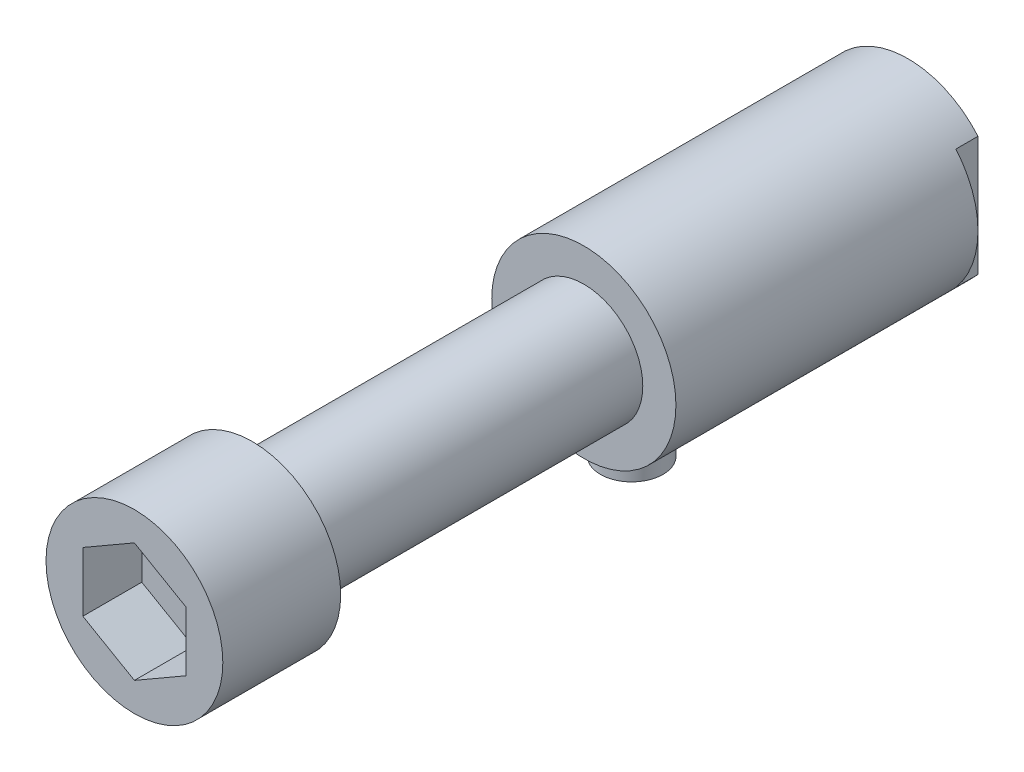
ISO-10303-21;
HEADER;
FILE_DESCRIPTION(('STEP AP214'),'2;1');
FILE_NAME('part.step','',(''),(''),'','','');
FILE_SCHEMA(('AUTOMOTIVE_DESIGN { 1 0 10303 214 1 1 1 1 }'));
ENDSEC;
DATA;
#1=APPLICATION_CONTEXT('core data for automotive mechanical design processes');
#2=APPLICATION_PROTOCOL_DEFINITION('international standard','automotive_design',2000,#1);
#3=PRODUCT_CONTEXT('',#1,'mechanical');
#4=PRODUCT('Part','Part','',(#3));
#5=PRODUCT_RELATED_PRODUCT_CATEGORY('part','',(#4));
#6=PRODUCT_DEFINITION_FORMATION('','',#4);
#7=PRODUCT_DEFINITION_CONTEXT('part definition',#1,'design');
#8=PRODUCT_DEFINITION('design','',#6,#7);
#9=PRODUCT_DEFINITION_SHAPE('','',#8);
#10=(LENGTH_UNIT() NAMED_UNIT(*) SI_UNIT(.MILLI.,.METRE.));
#11=(NAMED_UNIT(*) PLANE_ANGLE_UNIT() SI_UNIT($,.RADIAN.));
#12=(NAMED_UNIT(*) SI_UNIT($,.STERADIAN.) SOLID_ANGLE_UNIT());
#13=UNCERTAINTY_MEASURE_WITH_UNIT(LENGTH_MEASURE(1.E-05),#10,'distance_accuracy_value','');
#14=(GEOMETRIC_REPRESENTATION_CONTEXT(3) GLOBAL_UNCERTAINTY_ASSIGNED_CONTEXT((#13)) GLOBAL_UNIT_ASSIGNED_CONTEXT((#10,
#11,#12)) REPRESENTATION_CONTEXT('',''));
#15=CARTESIAN_POINT('',(0.,0.,0.));
#16=DIRECTION('',(0.,0.,1.));
#17=DIRECTION('',(1.,0.,0.));
#18=AXIS2_PLACEMENT_3D('',#15,#16,#17);
#19=CARTESIAN_POINT('',(0.,0.,0.));
#20=DIRECTION('',(0.,0.,1.));
#21=DIRECTION('',(1.,0.,0.));
#22=AXIS2_PLACEMENT_3D('',#19,#20,#21);
#23=CYLINDRICAL_SURFACE('',#22,12.5);
#24=CARTESIAN_POINT('',(0.,-12.5,33.25));
#25=CARTESIAN_POINT('',(0.231629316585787,-12.5000013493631,33.2499979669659));
#26=CARTESIAN_POINT('',(0.463244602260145,-12.493502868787,33.2689973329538));
#27=CARTESIAN_POINT('',(0.919637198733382,-12.4682205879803,33.3442489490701));
#28=CARTESIAN_POINT('',(1.14441406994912,-12.4494359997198,33.4005035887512));
#29=CARTESIAN_POINT('',(1.58048439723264,-12.4016188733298,33.5481034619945));
#30=CARTESIAN_POINT('',(1.79180021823,-12.3726038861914,33.639388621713));
#31=CARTESIAN_POINT('',(2.19612038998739,-12.3072763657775,33.8541815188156));
#32=CARTESIAN_POINT('',(2.38912089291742,-12.270962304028,33.9776960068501));
#33=CARTESIAN_POINT('',(2.75825261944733,-12.1933910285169,34.2580893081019));
#34=CARTESIAN_POINT('',(2.93363688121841,-12.1520119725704,34.4159175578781));
#35=CARTESIAN_POINT('',(3.25602333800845,-12.069633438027,34.7584402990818));
#36=CARTESIAN_POINT('',(3.40301894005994,-12.0286340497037,34.9431410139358));
#37=CARTESIAN_POINT('',(3.66879190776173,-11.9503048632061,35.3409772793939));
#38=CARTESIAN_POINT('',(3.78658554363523,-11.9131228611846,35.5548019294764));
#39=CARTESIAN_POINT('',(3.98421855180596,-11.8484975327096,36.000694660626));
#40=CARTESIAN_POINT('',(4.0640700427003,-11.8210510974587,36.2327568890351));
#41=CARTESIAN_POINT('',(4.18072715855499,-11.7802904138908,36.7000245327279));
#42=CARTESIAN_POINT('',(4.21893677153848,-11.7665167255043,36.9348381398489));
#43=CARTESIAN_POINT('',(4.25561504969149,-11.7533040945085,37.4079165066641));
#44=CARTESIAN_POINT('',(4.25409658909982,-11.7538605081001,37.6461801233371));
#45=CARTESIAN_POINT('',(4.21244934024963,-11.7688435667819,38.1072949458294));
#46=CARTESIAN_POINT('',(4.1741694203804,-11.7826060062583,38.3303385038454));
#47=CARTESIAN_POINT('',(4.06310816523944,-11.8213609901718,38.766625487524));
#48=CARTESIAN_POINT('',(3.99032254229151,-11.8463549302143,38.9798676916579));
#49=CARTESIAN_POINT('',(3.81113653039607,-11.9052184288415,39.3946323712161));
#50=CARTESIAN_POINT('',(3.70419900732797,-11.9392282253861,39.5959020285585));
#51=CARTESIAN_POINT('',(3.46011773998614,-12.0122344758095,39.9782170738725));
#52=CARTESIAN_POINT('',(3.3229649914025,-12.0512324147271,40.1592564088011));
#53=CARTESIAN_POINT('',(3.01353124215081,-12.1324166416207,40.506338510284));
#54=CARTESIAN_POINT('',(2.8397439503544,-12.1746609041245,40.6710276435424));
#55=CARTESIAN_POINT('',(2.46650176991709,-12.2557250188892,40.969285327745));
#56=CARTESIAN_POINT('',(2.26704421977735,-12.294544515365,41.102850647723));
#57=CARTESIAN_POINT('',(1.84516436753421,-12.3649312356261,41.3362182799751));
#58=CARTESIAN_POINT('',(1.62251944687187,-12.3964165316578,41.4356445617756));
#59=CARTESIAN_POINT('',(1.16233553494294,-12.4479909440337,41.5952073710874));
#60=CARTESIAN_POINT('',(0.924801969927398,-12.4680841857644,41.6553581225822));
#61=CARTESIAN_POINT('',(0.453032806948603,-12.4939206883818,41.7322333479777));
#62=CARTESIAN_POINT('',(0.219127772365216,-12.5002675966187,41.7507859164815));
#63=CARTESIAN_POINT('',(-0.248508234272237,-12.499715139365,41.7491633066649));
#64=CARTESIAN_POINT('',(-0.482239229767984,-12.4928181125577,41.7289949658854));
#65=CARTESIAN_POINT('',(-0.935487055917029,-12.4669514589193,41.6519417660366));
#66=CARTESIAN_POINT('',(-1.1552199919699,-12.4483547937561,41.5961904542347));
#67=CARTESIAN_POINT('',(-1.58211571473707,-12.4013331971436,41.450982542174));
#68=CARTESIAN_POINT('',(-1.78927688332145,-12.3729070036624,41.361521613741));
#69=CARTESIAN_POINT('',(-2.19135854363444,-12.3081499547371,41.1487765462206));
#70=CARTESIAN_POINT('',(-2.38580051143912,-12.2716272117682,41.024648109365));
#71=CARTESIAN_POINT('',(-2.75168306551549,-12.1948041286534,40.7470771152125));
#72=CARTESIAN_POINT('',(-2.92311635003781,-12.1545025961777,40.5936252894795));
#73=CARTESIAN_POINT('',(-3.24657351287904,-12.0722386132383,40.2531724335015));
#74=CARTESIAN_POINT('',(-3.39729328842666,-12.0302879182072,40.064926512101));
#75=CARTESIAN_POINT('',(-3.66518020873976,-11.9514023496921,39.6649221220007));
#76=CARTESIAN_POINT('',(-3.78234674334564,-11.914467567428,39.4531632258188));
#77=CARTESIAN_POINT('',(-3.97933669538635,-11.8501336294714,39.0118433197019));
#78=CARTESIAN_POINT('',(-4.05920753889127,-11.8227223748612,38.782305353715));
#79=CARTESIAN_POINT('',(-4.1787762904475,-11.7809981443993,38.3118824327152));
#80=CARTESIAN_POINT('',(-4.21849327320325,-11.7666789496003,38.0710029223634));
#81=CARTESIAN_POINT('',(-4.25510290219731,-11.7534862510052,37.5985747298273));
#82=CARTESIAN_POINT('',(-4.25416884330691,-11.7538288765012,37.367214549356));
#83=CARTESIAN_POINT('',(-4.21488538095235,-11.7679720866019,36.9081334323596));
#84=CARTESIAN_POINT('',(-4.17653837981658,-11.781771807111,36.6804122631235));
#85=CARTESIAN_POINT('',(-4.06508169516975,-11.8206793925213,36.2397513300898));
#86=CARTESIAN_POINT('',(-3.99270334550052,-11.8455487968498,36.0266038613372));
#87=CARTESIAN_POINT('',(-3.81583792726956,-11.9036971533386,35.6153188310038));
#88=CARTESIAN_POINT('',(-3.71134355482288,-11.9369780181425,35.4171846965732));
#89=CARTESIAN_POINT('',(-3.46772073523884,-12.0100690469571,35.0318662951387));
#90=CARTESIAN_POINT('',(-3.32724348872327,-12.0501058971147,34.8455781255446));
#91=CARTESIAN_POINT('',(-3.01789256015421,-12.1312763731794,34.4985180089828));
#92=CARTESIAN_POINT('',(-2.84901069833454,-12.1724103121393,34.337753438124));
#93=CARTESIAN_POINT('',(-2.47930158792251,-12.2531734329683,34.0396203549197));
#94=CARTESIAN_POINT('',(-2.27744544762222,-12.2926709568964,33.9034874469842));
#95=CARTESIAN_POINT('',(-1.85239769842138,-12.3638575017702,33.6672194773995));
#96=CARTESIAN_POINT('',(-1.62921053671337,-12.3955481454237,33.5670769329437));
#97=CARTESIAN_POINT('',(-1.17498554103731,-12.4466848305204,33.4088004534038));
#98=CARTESIAN_POINT('',(-0.944413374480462,-12.4664836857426,33.3494476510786));
#99=CARTESIAN_POINT('',(-0.475887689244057,-12.4931386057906,33.2700544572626));
#100=CARTESIAN_POINT('',(-0.237936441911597,-12.4999986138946,33.2500020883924));
#101=CARTESIAN_POINT('',(0.,-12.5,33.25));
#102=B_SPLINE_CURVE_WITH_KNOTS('',3,(#24,#25,#26,#27,#28,#29,#30,#31,#32,#33,#34,#35,#36,#37,
#38,#39,#40,#41,#42,#43,#44,#45,#46,#47,#48,#49,#50,#51,#52,#53,#54,#55,#56,#57,#58,#59,#60,#61,
#62,#63,#64,#65,#66,#67,#68,#69,#70,#71,#72,#73,#74,#75,#76,#77,#78,#79,#80,#81,#82,#83,#84,#85,
#86,#87,#88,#89,#90,#91,#92,#93,#94,#95,#96,#97,#98,#99,#100,#101),.UNSPECIFIED.,.T.,.F.,(4,2,2,
2,2,2,2,2,2,2,2,2,2,2,2,2,2,2,2,2,2,2,2,2,2,2,2,2,2,2,2,2,2,2,2,2,2,2,4),(0.,0.694012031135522,
1.38806858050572,2.08094017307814,2.77395700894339,3.48937549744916,4.20495993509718,
4.94210626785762,5.67901699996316,6.39023024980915,7.10121302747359,7.7782140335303,
8.45529918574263,9.14360628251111,9.83211877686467,10.5581272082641,11.2842109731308,
12.0180534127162,12.7516299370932,13.4522781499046,14.1528026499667,14.8320547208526,
15.5113940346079,16.2089885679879,16.9068039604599,17.6376748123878,18.3685589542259,
19.0985111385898,19.8281164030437,20.5187658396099,21.2093709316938,21.8857695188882,
22.5623220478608,23.2693695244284,23.976620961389,24.7129879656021,25.4492017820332,
26.1623287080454,26.8752382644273),.UNSPECIFIED.);
#103=CARTESIAN_POINT('',(0.,-12.5,33.25));
#104=VERTEX_POINT('',#103);
#105=EDGE_CURVE('E9',#104,#104,#102,.T.);
#106=ORIENTED_EDGE('',*,*,#105,.F.);
#107=EDGE_LOOP('',(#106));
#108=FACE_BOUND('',#107,.T.);
#109=CARTESIAN_POINT('',(0.,0.,0.));
#110=DIRECTION('',(0.,0.,-1.));
#111=DIRECTION('',(-1.,0.,0.));
#112=AXIS2_PLACEMENT_3D('',#109,#110,#111);
#113=CIRCLE('',#112,12.5);
#114=CARTESIAN_POINT('',(9.5,-8.12403840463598,0.));
#115=VERTEX_POINT('',#114);
#116=CARTESIAN_POINT('',(-9.5,-8.12403840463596,0.));
#117=VERTEX_POINT('',#116);
#118=EDGE_CURVE('E155',#115,#117,#113,.T.);
#119=ORIENTED_EDGE('',*,*,#118,.F.);
#120=DIRECTION('',(0.,0.,-1.));
#121=VECTOR('',#120,1.);
#122=CARTESIAN_POINT('',(9.5,-8.12403840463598,3.));
#123=LINE('',#122,#121);
#124=CARTESIAN_POINT('',(9.5,-8.12403840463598,3.));
#125=VERTEX_POINT('',#124);
#126=EDGE_CURVE('E136',#125,#115,#123,.T.);
#127=ORIENTED_EDGE('',*,*,#126,.F.);
#128=CARTESIAN_POINT('',(0.,0.,3.));
#129=DIRECTION('',(0.,0.,-1.));
#130=DIRECTION('',(-1.,0.,0.));
#131=AXIS2_PLACEMENT_3D('',#128,#129,#130);
#132=CIRCLE('',#131,12.5);
#133=CARTESIAN_POINT('',(9.5,8.12403840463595,3.));
#134=VERTEX_POINT('',#133);
#135=EDGE_CURVE('E140',#134,#125,#132,.T.);
#136=ORIENTED_EDGE('',*,*,#135,.F.);
#137=DIRECTION('',(0.,0.,-1.));
#138=VECTOR('',#137,1.);
#139=CARTESIAN_POINT('',(9.5,8.12403840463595,3.));
#140=LINE('',#139,#138);
#141=CARTESIAN_POINT('',(9.5,8.12403840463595,0.));
#142=VERTEX_POINT('',#141);
#143=EDGE_CURVE('E133',#134,#142,#140,.T.);
#144=ORIENTED_EDGE('',*,*,#143,.T.);
#145=CARTESIAN_POINT('',(-9.5,8.12403840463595,0.));
#146=VERTEX_POINT('',#145);
#147=EDGE_CURVE('E148',#146,#142,#113,.T.);
#148=ORIENTED_EDGE('',*,*,#147,.F.);
#149=DIRECTION('',(0.,0.,-1.));
#150=VECTOR('',#149,1.);
#151=CARTESIAN_POINT('',(-9.5,8.12403840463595,3.));
#152=LINE('',#151,#150);
#153=CARTESIAN_POINT('',(-9.5,8.12403840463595,3.));
#154=VERTEX_POINT('',#153);
#155=EDGE_CURVE('E604',#154,#146,#152,.T.);
#156=ORIENTED_EDGE('',*,*,#155,.F.);
#157=CARTESIAN_POINT('',(0.,0.,3.));
#158=DIRECTION('',(0.,0.,-1.));
#159=DIRECTION('',(-1.,0.,0.));
#160=AXIS2_PLACEMENT_3D('',#157,#158,#159);
#161=CIRCLE('',#160,12.5);
#162=CARTESIAN_POINT('',(-9.5,-8.12403840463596,3.));
#163=VERTEX_POINT('',#162);
#164=EDGE_CURVE('E611',#163,#154,#161,.T.);
#165=ORIENTED_EDGE('',*,*,#164,.F.);
#166=DIRECTION('',(0.,0.,-1.));
#167=VECTOR('',#166,1.);
#168=CARTESIAN_POINT('',(-9.5,-8.12403840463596,3.));
#169=LINE('',#168,#167);
#170=EDGE_CURVE('E602',#163,#117,#169,.T.);
#171=ORIENTED_EDGE('',*,*,#170,.T.);
#172=EDGE_LOOP('',(#119,#127,#136,#144,#148,#156,#165,#171));
#173=FACE_BOUND('',#172,.T.);
#174=CARTESIAN_POINT('',(0.,0.,44.));
#175=DIRECTION('',(0.,0.,-1.));
#176=DIRECTION('',(-1.,0.,0.));
#177=AXIS2_PLACEMENT_3D('',#174,#175,#176);
#178=CIRCLE('',#177,12.5);
#179=CARTESIAN_POINT('',(-12.5,0.,44.));
#180=VERTEX_POINT('',#179);
#181=EDGE_CURVE('E160',#180,#180,#178,.T.);
#182=ORIENTED_EDGE('',*,*,#181,.T.);
#183=EDGE_LOOP('',(#182));
#184=FACE_BOUND('',#183,.T.);
#185=ADVANCED_FACE('F14',(#108,#173,#184),#23,.T.);
#186=CARTESIAN_POINT('',(0.,0.,0.));
#187=DIRECTION('',(0.,0.,-1.));
#188=DIRECTION('',(-1.,0.,0.));
#189=AXIS2_PLACEMENT_3D('',#186,#187,#188);
#190=PLANE('',#189);
#191=CARTESIAN_POINT('',(0.,0.,0.));
#192=DIRECTION('',(0.,0.,-1.));
#193=DIRECTION('',(-1.,0.,0.));
#194=AXIS2_PLACEMENT_3D('',#191,#192,#193);
#195=CIRCLE('',#194,5.75);
#196=CARTESIAN_POINT('',(-5.75,0.,0.));
#197=VERTEX_POINT('',#196);
#198=EDGE_CURVE('E141',#197,#197,#195,.T.);
#199=ORIENTED_EDGE('',*,*,#198,.F.);
#200=EDGE_LOOP('',(#199));
#201=FACE_BOUND('',#200,.T.);
#202=DIRECTION('',(0.,1.,0.));
#203=VECTOR('',#202,1.);
#204=CARTESIAN_POINT('',(9.5,8.12403840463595,0.));
#205=LINE('',#204,#203);
#206=EDGE_CURVE('E129',#115,#142,#205,.T.);
#207=ORIENTED_EDGE('',*,*,#206,.F.);
#208=ORIENTED_EDGE('',*,*,#118,.T.);
#209=DIRECTION('',(0.,-1.,0.));
#210=VECTOR('',#209,1.);
#211=CARTESIAN_POINT('',(-9.5,-8.12403840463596,0.));
#212=LINE('',#211,#210);
#213=EDGE_CURVE('E149',#146,#117,#212,.T.);
#214=ORIENTED_EDGE('',*,*,#213,.F.);
#215=ORIENTED_EDGE('',*,*,#147,.T.);
#216=EDGE_LOOP('',(#207,#208,#214,#215));
#217=FACE_BOUND('',#216,.T.);
#218=ADVANCED_FACE('F152',(#201,#217),#190,.T.);
#219=CARTESIAN_POINT('',(0.,0.,44.));
#220=DIRECTION('',(0.,0.,-1.));
#221=DIRECTION('',(-1.,0.,0.));
#222=AXIS2_PLACEMENT_3D('',#219,#220,#221);
#223=PLANE('',#222);
#224=CARTESIAN_POINT('',(0.,0.,44.));
#225=DIRECTION('',(0.,0.,-1.));
#226=DIRECTION('',(-1.,0.,0.));
#227=AXIS2_PLACEMENT_3D('',#224,#225,#226);
#228=CIRCLE('',#227,8.);
#229=CARTESIAN_POINT('',(-8.,0.,44.));
#230=VERTEX_POINT('',#229);
#231=EDGE_CURVE('E218',#230,#230,#228,.F.);
#232=ORIENTED_EDGE('',*,*,#231,.F.);
#233=EDGE_LOOP('',(#232));
#234=FACE_BOUND('',#233,.T.);
#235=ORIENTED_EDGE('',*,*,#181,.F.);
#236=EDGE_LOOP('',(#235));
#237=FACE_BOUND('',#236,.T.);
#238=ADVANCED_FACE('F283',(#234,#237),#223,.F.);
#239=CARTESIAN_POINT('',(-9.5,-8.12403840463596,3.));
#240=DIRECTION('',(1.,0.,0.));
#241=DIRECTION('',(0.,0.,-1.));
#242=AXIS2_PLACEMENT_3D('',#239,#240,#241);
#243=PLANE('',#242);
#244=ORIENTED_EDGE('',*,*,#213,.T.);
#245=ORIENTED_EDGE('',*,*,#170,.F.);
#246=DIRECTION('',(0.,-1.,0.));
#247=VECTOR('',#246,1.);
#248=CARTESIAN_POINT('',(-9.5,-8.12403840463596,3.));
#249=LINE('',#248,#247);
#250=EDGE_CURVE('E607',#154,#163,#249,.T.);
#251=ORIENTED_EDGE('',*,*,#250,.F.);
#252=ORIENTED_EDGE('',*,*,#155,.T.);
#253=EDGE_LOOP('',(#244,#245,#251,#252));
#254=FACE_BOUND('',#253,.T.);
#255=ADVANCED_FACE('F385',(#254),#243,.F.);
#256=CARTESIAN_POINT('',(0.,0.,3.));
#257=DIRECTION('',(0.,0.,-1.));
#258=DIRECTION('',(-1.,0.,0.));
#259=AXIS2_PLACEMENT_3D('',#256,#257,#258);
#260=PLANE('',#259);
#261=ORIENTED_EDGE('',*,*,#164,.T.);
#262=ORIENTED_EDGE('',*,*,#250,.T.);
#263=EDGE_LOOP('',(#261,#262));
#264=FACE_BOUND('',#263,.T.);
#265=ADVANCED_FACE('F394',(#264),#260,.T.);
#266=CARTESIAN_POINT('',(9.5,8.12403840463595,3.));
#267=DIRECTION('',(-1.,0.,0.));
#268=DIRECTION('',(0.,0.,1.));
#269=AXIS2_PLACEMENT_3D('',#266,#267,#268);
#270=PLANE('',#269);
#271=ORIENTED_EDGE('',*,*,#206,.T.);
#272=ORIENTED_EDGE('',*,*,#143,.F.);
#273=DIRECTION('',(0.,1.,0.));
#274=VECTOR('',#273,1.);
#275=CARTESIAN_POINT('',(9.5,8.12403840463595,3.));
#276=LINE('',#275,#274);
#277=EDGE_CURVE('E614',#125,#134,#276,.T.);
#278=ORIENTED_EDGE('',*,*,#277,.F.);
#279=ORIENTED_EDGE('',*,*,#126,.T.);
#280=EDGE_LOOP('',(#271,#272,#278,#279));
#281=FACE_BOUND('',#280,.T.);
#282=ADVANCED_FACE('F131',(#281),#270,.F.);
#283=CARTESIAN_POINT('',(0.,0.,3.));
#284=DIRECTION('',(0.,0.,-1.));
#285=DIRECTION('',(-1.,0.,0.));
#286=AXIS2_PLACEMENT_3D('',#283,#284,#285);
#287=PLANE('',#286);
#288=ORIENTED_EDGE('',*,*,#135,.T.);
#289=ORIENTED_EDGE('',*,*,#277,.T.);
#290=EDGE_LOOP('',(#288,#289));
#291=FACE_BOUND('',#290,.T.);
#292=ADVANCED_FACE('F409',(#291),#287,.T.);
#293=CARTESIAN_POINT('',(0.,0.,0.));
#294=DIRECTION('',(0.,0.,-1.));
#295=DIRECTION('',(-1.,0.,0.));
#296=AXIS2_PLACEMENT_3D('',#293,#294,#295);
#297=CONICAL_SURFACE('',#296,5.75,0.523598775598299);
#298=CARTESIAN_POINT('',(0.,0.,1.29903810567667));
#299=DIRECTION('',(0.,0.,-1.));
#300=DIRECTION('',(-1.,0.,0.));
#301=AXIS2_PLACEMENT_3D('',#298,#299,#300);
#302=CIRCLE('',#301,5.);
#303=CARTESIAN_POINT('',(-5.,0.,1.29903810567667));
#304=VERTEX_POINT('',#303);
#305=EDGE_CURVE('E620',#304,#304,#302,.T.);
#306=ORIENTED_EDGE('',*,*,#305,.F.);
#307=EDGE_LOOP('',(#306));
#308=FACE_BOUND('',#307,.T.);
#309=ORIENTED_EDGE('',*,*,#198,.T.);
#310=EDGE_LOOP('',(#309));
#311=FACE_BOUND('',#310,.T.);
#312=ADVANCED_FACE('F375',(#308,#311),#297,.F.);
#313=CARTESIAN_POINT('',(0.,0.,0.));
#314=DIRECTION('',(0.,0.,-1.));
#315=DIRECTION('',(-1.,0.,0.));
#316=AXIS2_PLACEMENT_3D('',#313,#314,#315);
#317=CYLINDRICAL_SURFACE('',#316,5.);
#318=CARTESIAN_POINT('',(0.,0.,15.));
#319=DIRECTION('',(0.,0.,-1.));
#320=DIRECTION('',(-1.,0.,0.));
#321=AXIS2_PLACEMENT_3D('',#318,#319,#320);
#322=CIRCLE('',#321,5.);
#323=CARTESIAN_POINT('',(-5.,0.,15.));
#324=VERTEX_POINT('',#323);
#325=EDGE_CURVE('E623',#324,#324,#322,.T.);
#326=ORIENTED_EDGE('',*,*,#325,.F.);
#327=EDGE_LOOP('',(#326));
#328=FACE_BOUND('',#327,.T.);
#329=ORIENTED_EDGE('',*,*,#305,.T.);
#330=EDGE_LOOP('',(#329));
#331=FACE_BOUND('',#330,.T.);
#332=ADVANCED_FACE('F362',(#328,#331),#317,.F.);
#333=CARTESIAN_POINT('',(-7.,12.1243556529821,96.9993629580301));
#334=DIRECTION('',(0.,0.,-1.));
#335=DIRECTION('',(-1.,0.,0.));
#336=AXIS2_PLACEMENT_3D('',#333,#334,#335);
#337=PLANE('',#336);
#338=DIRECTION('',(0.86602540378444,-0.5,0.));
#339=VECTOR('',#338,1.);
#340=CARTESIAN_POINT('',(0.,8.08290376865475,96.9993629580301));
#341=LINE('',#340,#339);
#342=CARTESIAN_POINT('',(0.,8.08290376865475,96.9993629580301));
#343=VERTEX_POINT('',#342);
#344=CARTESIAN_POINT('',(7.,4.0414518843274,96.9993629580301));
#345=VERTEX_POINT('',#344);
#346=EDGE_CURVE('E167',#343,#345,#341,.T.);
#347=ORIENTED_EDGE('',*,*,#346,.F.);
#348=DIRECTION('',(-0.86602540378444,-0.5,0.));
#349=VECTOR('',#348,1.);
#350=CARTESIAN_POINT('',(0.,8.08290376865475,96.9993629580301));
#351=LINE('',#350,#349);
#352=CARTESIAN_POINT('',(-7.,4.0414518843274,96.9993629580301));
#353=VERTEX_POINT('',#352);
#354=EDGE_CURVE('E179',#343,#353,#351,.T.);
#355=ORIENTED_EDGE('',*,*,#354,.T.);
#356=DIRECTION('',(0.,-1.,0.));
#357=VECTOR('',#356,1.);
#358=CARTESIAN_POINT('',(-7.,4.0414518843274,96.9993629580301));
#359=LINE('',#358,#357);
#360=CARTESIAN_POINT('',(-7.,-4.0414518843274,96.9993629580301));
#361=VERTEX_POINT('',#360);
#362=EDGE_CURVE('E183',#353,#361,#359,.T.);
#363=ORIENTED_EDGE('',*,*,#362,.T.);
#364=DIRECTION('',(-0.86602540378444,0.5,0.));
#365=VECTOR('',#364,1.);
#366=CARTESIAN_POINT('',(0.,-8.08290376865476,96.9993629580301));
#367=LINE('',#366,#365);
#368=CARTESIAN_POINT('',(0.,-8.08290376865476,96.9993629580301));
#369=VERTEX_POINT('',#368);
#370=EDGE_CURVE('E186',#369,#361,#367,.T.);
#371=ORIENTED_EDGE('',*,*,#370,.F.);
#372=DIRECTION('',(0.86602540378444,0.5,0.));
#373=VECTOR('',#372,1.);
#374=CARTESIAN_POINT('',(0.,-8.08290376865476,96.9993629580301));
#375=LINE('',#374,#373);
#376=CARTESIAN_POINT('',(7.,-4.0414518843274,96.9993629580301));
#377=VERTEX_POINT('',#376);
#378=EDGE_CURVE('E189',#369,#377,#375,.T.);
#379=ORIENTED_EDGE('',*,*,#378,.T.);
#380=DIRECTION('',(0.,1.,0.));
#381=VECTOR('',#380,1.);
#382=CARTESIAN_POINT('',(7.,-4.0414518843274,96.9993629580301));
#383=LINE('',#382,#381);
#384=EDGE_CURVE('E192',#377,#345,#383,.T.);
#385=ORIENTED_EDGE('',*,*,#384,.T.);
#386=EDGE_LOOP('',(#347,#355,#363,#371,#379,#385));
#387=FACE_BOUND('',#386,.T.);
#388=ADVANCED_FACE('F273',(#387),#337,.F.);
#389=CARTESIAN_POINT('',(-7.,4.0414518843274,96.9993629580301));
#390=DIRECTION('',(-1.,0.,0.));
#391=DIRECTION('',(0.,-1.,0.));
#392=AXIS2_PLACEMENT_3D('',#389,#390,#391);
#393=PLANE('',#392);
#394=DIRECTION('',(0.,0.,1.));
#395=VECTOR('',#394,1.);
#396=CARTESIAN_POINT('',(-7.,4.0414518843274,96.9993629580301));
#397=LINE('',#396,#395);
#398=CARTESIAN_POINT('',(-7.,4.0414518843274,104.99936295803));
#399=VERTEX_POINT('',#398);
#400=EDGE_CURVE('E199',#353,#399,#397,.T.);
#401=ORIENTED_EDGE('',*,*,#400,.T.);
#402=DIRECTION('',(0.,-1.,0.));
#403=VECTOR('',#402,1.);
#404=CARTESIAN_POINT('',(-7.,4.0414518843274,104.99936295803));
#405=LINE('',#404,#403);
#406=CARTESIAN_POINT('',(-7.,-4.0414518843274,104.99936295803));
#407=VERTEX_POINT('',#406);
#408=EDGE_CURVE('E168',#399,#407,#405,.T.);
#409=ORIENTED_EDGE('',*,*,#408,.T.);
#410=DIRECTION('',(0.,0.,1.));
#411=VECTOR('',#410,1.);
#412=CARTESIAN_POINT('',(-7.,-4.0414518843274,96.9993629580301));
#413=LINE('',#412,#411);
#414=EDGE_CURVE('E201',#361,#407,#413,.T.);
#415=ORIENTED_EDGE('',*,*,#414,.F.);
#416=ORIENTED_EDGE('',*,*,#362,.F.);
#417=EDGE_LOOP('',(#401,#409,#415,#416));
#418=FACE_BOUND('',#417,.T.);
#419=ADVANCED_FACE('F428',(#418),#393,.F.);
#420=CARTESIAN_POINT('',(0.,-8.08290376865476,96.9993629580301));
#421=DIRECTION('',(0.5,0.86602540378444,0.));
#422=DIRECTION('',(-0.86602540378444,0.5,0.));
#423=AXIS2_PLACEMENT_3D('',#420,#421,#422);
#424=PLANE('',#423);
#425=ORIENTED_EDGE('',*,*,#414,.T.);
#426=DIRECTION('',(-0.86602540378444,0.5,0.));
#427=VECTOR('',#426,1.);
#428=CARTESIAN_POINT('',(0.,-8.08290376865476,104.99936295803));
#429=LINE('',#428,#427);
#430=CARTESIAN_POINT('',(0.,-8.08290376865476,104.99936295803));
#431=VERTEX_POINT('',#430);
#432=EDGE_CURVE('E171',#431,#407,#429,.T.);
#433=ORIENTED_EDGE('',*,*,#432,.F.);
#434=DIRECTION('',(0.,0.,1.));
#435=VECTOR('',#434,1.);
#436=CARTESIAN_POINT('',(0.,-8.08290376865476,96.9993629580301));
#437=LINE('',#436,#435);
#438=EDGE_CURVE('E203',#369,#431,#437,.T.);
#439=ORIENTED_EDGE('',*,*,#438,.F.);
#440=ORIENTED_EDGE('',*,*,#370,.T.);
#441=EDGE_LOOP('',(#425,#433,#439,#440));
#442=FACE_BOUND('',#441,.T.);
#443=ADVANCED_FACE('F435',(#442),#424,.T.);
#444=CARTESIAN_POINT('',(0.,-8.08290376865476,96.9993629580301));
#445=DIRECTION('',(0.5,-0.86602540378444,0.));
#446=DIRECTION('',(0.86602540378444,0.5,0.));
#447=AXIS2_PLACEMENT_3D('',#444,#445,#446);
#448=PLANE('',#447);
#449=ORIENTED_EDGE('',*,*,#438,.T.);
#450=DIRECTION('',(0.86602540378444,0.5,0.));
#451=VECTOR('',#450,1.);
#452=CARTESIAN_POINT('',(0.,-8.08290376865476,104.99936295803));
#453=LINE('',#452,#451);
#454=CARTESIAN_POINT('',(7.,-4.0414518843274,104.99936295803));
#455=VERTEX_POINT('',#454);
#456=EDGE_CURVE('E174',#431,#455,#453,.T.);
#457=ORIENTED_EDGE('',*,*,#456,.T.);
#458=DIRECTION('',(0.,0.,1.));
#459=VECTOR('',#458,1.);
#460=CARTESIAN_POINT('',(7.,-4.0414518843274,96.9993629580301));
#461=LINE('',#460,#459);
#462=EDGE_CURVE('E205',#377,#455,#461,.T.);
#463=ORIENTED_EDGE('',*,*,#462,.F.);
#464=ORIENTED_EDGE('',*,*,#378,.F.);
#465=EDGE_LOOP('',(#449,#457,#463,#464));
#466=FACE_BOUND('',#465,.T.);
#467=ADVANCED_FACE('F443',(#466),#448,.F.);
#468=CARTESIAN_POINT('',(7.,-4.0414518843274,96.9993629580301));
#469=DIRECTION('',(1.,0.,0.));
#470=DIRECTION('',(0.,1.,0.));
#471=AXIS2_PLACEMENT_3D('',#468,#469,#470);
#472=PLANE('',#471);
#473=ORIENTED_EDGE('',*,*,#462,.T.);
#474=DIRECTION('',(0.,1.,0.));
#475=VECTOR('',#474,1.);
#476=CARTESIAN_POINT('',(7.,-4.0414518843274,104.99936295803));
#477=LINE('',#476,#475);
#478=CARTESIAN_POINT('',(7.,4.0414518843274,104.99936295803));
#479=VERTEX_POINT('',#478);
#480=EDGE_CURVE('E158',#455,#479,#477,.T.);
#481=ORIENTED_EDGE('',*,*,#480,.T.);
#482=DIRECTION('',(0.,0.,1.));
#483=VECTOR('',#482,1.);
#484=CARTESIAN_POINT('',(7.,4.0414518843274,96.9993629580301));
#485=LINE('',#484,#483);
#486=EDGE_CURVE('E207',#345,#479,#485,.T.);
#487=ORIENTED_EDGE('',*,*,#486,.F.);
#488=ORIENTED_EDGE('',*,*,#384,.F.);
#489=EDGE_LOOP('',(#473,#481,#487,#488));
#490=FACE_BOUND('',#489,.T.);
#491=ADVANCED_FACE('F451',(#490),#472,.F.);
#492=CARTESIAN_POINT('',(0.,8.08290376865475,96.9993629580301));
#493=DIRECTION('',(-0.5,-0.86602540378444,0.));
#494=DIRECTION('',(0.86602540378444,-0.5,0.));
#495=AXIS2_PLACEMENT_3D('',#492,#493,#494);
#496=PLANE('',#495);
#497=ORIENTED_EDGE('',*,*,#486,.T.);
#498=DIRECTION('',(0.86602540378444,-0.5,0.));
#499=VECTOR('',#498,1.);
#500=CARTESIAN_POINT('',(0.,8.08290376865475,104.99936295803));
#501=LINE('',#500,#499);
#502=CARTESIAN_POINT('',(0.,8.08290376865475,104.99936295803));
#503=VERTEX_POINT('',#502);
#504=EDGE_CURVE('E154',#503,#479,#501,.T.);
#505=ORIENTED_EDGE('',*,*,#504,.F.);
#506=DIRECTION('',(0.,0.,1.));
#507=VECTOR('',#506,1.);
#508=CARTESIAN_POINT('',(0.,8.08290376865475,96.9993629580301));
#509=LINE('',#508,#507);
#510=EDGE_CURVE('E182',#343,#503,#509,.T.);
#511=ORIENTED_EDGE('',*,*,#510,.F.);
#512=ORIENTED_EDGE('',*,*,#346,.T.);
#513=EDGE_LOOP('',(#497,#505,#511,#512));
#514=FACE_BOUND('',#513,.T.);
#515=ADVANCED_FACE('F459',(#514),#496,.T.);
#516=CARTESIAN_POINT('',(0.,8.08290376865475,96.9993629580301));
#517=DIRECTION('',(-0.5,0.86602540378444,0.));
#518=DIRECTION('',(-0.86602540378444,-0.5,0.));
#519=AXIS2_PLACEMENT_3D('',#516,#517,#518);
#520=PLANE('',#519);
#521=ORIENTED_EDGE('',*,*,#354,.F.);
#522=ORIENTED_EDGE('',*,*,#510,.T.);
#523=DIRECTION('',(-0.86602540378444,-0.5,0.));
#524=VECTOR('',#523,1.);
#525=CARTESIAN_POINT('',(0.,8.08290376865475,104.99936295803));
#526=LINE('',#525,#524);
#527=EDGE_CURVE('E164',#503,#399,#526,.T.);
#528=ORIENTED_EDGE('',*,*,#527,.T.);
#529=ORIENTED_EDGE('',*,*,#400,.F.);
#530=EDGE_LOOP('',(#521,#522,#528,#529));
#531=FACE_BOUND('',#530,.T.);
#532=ADVANCED_FACE('F467',(#531),#520,.F.);
#533=CARTESIAN_POINT('',(0.,0.,104.99936295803));
#534=DIRECTION('',(0.,0.,1.));
#535=DIRECTION('',(1.,0.,0.));
#536=AXIS2_PLACEMENT_3D('',#533,#534,#535);
#537=PLANE('',#536);
#538=CARTESIAN_POINT('',(0.,0.,104.99936295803));
#539=DIRECTION('',(0.,0.,1.));
#540=DIRECTION('',(1.,0.,0.));
#541=AXIS2_PLACEMENT_3D('',#538,#539,#540);
#542=CIRCLE('',#541,12.);
#543=CARTESIAN_POINT('',(12.,0.,104.99936295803));
#544=VERTEX_POINT('',#543);
#545=EDGE_CURVE('E215',#544,#544,#542,.T.);
#546=ORIENTED_EDGE('',*,*,#545,.T.);
#547=EDGE_LOOP('',(#546));
#548=FACE_BOUND('',#547,.T.);
#549=ORIENTED_EDGE('',*,*,#527,.F.);
#550=ORIENTED_EDGE('',*,*,#504,.T.);
#551=ORIENTED_EDGE('',*,*,#480,.F.);
#552=ORIENTED_EDGE('',*,*,#456,.F.);
#553=ORIENTED_EDGE('',*,*,#432,.T.);
#554=ORIENTED_EDGE('',*,*,#408,.F.);
#555=EDGE_LOOP('',(#549,#550,#551,#552,#553,#554));
#556=FACE_BOUND('',#555,.T.);
#557=ADVANCED_FACE('F306',(#548,#556),#537,.T.);
#558=CARTESIAN_POINT('',(0.,0.,28.99936295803));
#559=DIRECTION('',(0.,0.,1.));
#560=DIRECTION('',(1.,0.,0.));
#561=AXIS2_PLACEMENT_3D('',#558,#559,#560);
#562=CYLINDRICAL_SURFACE('',#561,12.);
#563=CARTESIAN_POINT('',(0.,0.,88.9993629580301));
#564=DIRECTION('',(0.,0.,1.));
#565=DIRECTION('',(1.,0.,0.));
#566=AXIS2_PLACEMENT_3D('',#563,#564,#565);
#567=CIRCLE('',#566,12.);
#568=CARTESIAN_POINT('',(12.,0.,88.9993629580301));
#569=VERTEX_POINT('',#568);
#570=EDGE_CURVE('E212',#569,#569,#567,.T.);
#571=ORIENTED_EDGE('',*,*,#570,.T.);
#572=EDGE_LOOP('',(#571));
#573=FACE_BOUND('',#572,.T.);
#574=ORIENTED_EDGE('',*,*,#545,.F.);
#575=EDGE_LOOP('',(#574));
#576=FACE_BOUND('',#575,.T.);
#577=ADVANCED_FACE('F482',(#573,#576),#562,.T.);
#578=CARTESIAN_POINT('',(12.,0.,88.9993629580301));
#579=DIRECTION('',(0.,0.,-1.));
#580=DIRECTION('',(-1.,0.,0.));
#581=AXIS2_PLACEMENT_3D('',#578,#579,#580);
#582=PLANE('',#581);
#583=CARTESIAN_POINT('',(0.,0.,88.9993629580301));
#584=DIRECTION('',(0.,0.,1.));
#585=DIRECTION('',(1.,0.,0.));
#586=AXIS2_PLACEMENT_3D('',#583,#584,#585);
#587=CIRCLE('',#586,8.);
#588=CARTESIAN_POINT('',(8.,0.,88.9993629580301));
#589=VERTEX_POINT('',#588);
#590=EDGE_CURVE('E209',#589,#589,#587,.T.);
#591=ORIENTED_EDGE('',*,*,#590,.T.);
#592=EDGE_LOOP('',(#591));
#593=FACE_BOUND('',#592,.T.);
#594=ORIENTED_EDGE('',*,*,#570,.F.);
#595=EDGE_LOOP('',(#594));
#596=FACE_BOUND('',#595,.T.);
#597=ADVANCED_FACE('F290',(#593,#596),#582,.T.);
#598=CARTESIAN_POINT('',(0.,0.,28.99936295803));
#599=DIRECTION('',(0.,0.,1.));
#600=DIRECTION('',(1.,0.,0.));
#601=AXIS2_PLACEMENT_3D('',#598,#599,#600);
#602=CYLINDRICAL_SURFACE('',#601,8.);
#603=ORIENTED_EDGE('',*,*,#590,.F.);
#604=EDGE_LOOP('',(#603));
#605=FACE_BOUND('',#604,.T.);
#606=ORIENTED_EDGE('',*,*,#231,.T.);
#607=EDGE_LOOP('',(#606));
#608=FACE_BOUND('',#607,.T.);
#609=ADVANCED_FACE('F277',(#605,#608),#602,.T.);
#610=CARTESIAN_POINT('',(3.46410161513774,-13.,39.5));
#611=DIRECTION('',(0.,1.,0.));
#612=DIRECTION('',(0.,0.,1.));
#613=AXIS2_PLACEMENT_3D('',#610,#611,#612);
#614=PLANE('',#613);
#615=DIRECTION('',(-0.5,0.,-0.866025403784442));
#616=VECTOR('',#615,1.);
#617=CARTESIAN_POINT('',(2.30940107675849,-13.,37.5));
#618=LINE('',#617,#616);
#619=CARTESIAN_POINT('',(2.30940107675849,-13.,37.5));
#620=VERTEX_POINT('',#619);
#621=CARTESIAN_POINT('',(1.15470053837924,-13.,35.5));
#622=VERTEX_POINT('',#621);
#623=EDGE_CURVE('E224',#620,#622,#618,.T.);
#624=ORIENTED_EDGE('',*,*,#623,.F.);
#625=DIRECTION('',(-0.5,0.,0.866025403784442));
#626=VECTOR('',#625,1.);
#627=CARTESIAN_POINT('',(2.30940107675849,-13.,37.5));
#628=LINE('',#627,#626);
#629=CARTESIAN_POINT('',(1.15470053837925,-13.,39.5));
#630=VERTEX_POINT('',#629);
#631=EDGE_CURVE('E238',#620,#630,#628,.T.);
#632=ORIENTED_EDGE('',*,*,#631,.T.);
#633=DIRECTION('',(-1.,0.,0.));
#634=VECTOR('',#633,1.);
#635=CARTESIAN_POINT('',(1.15470053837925,-13.,39.5));
#636=LINE('',#635,#634);
#637=CARTESIAN_POINT('',(-1.15470053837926,-13.,39.5));
#638=VERTEX_POINT('',#637);
#639=EDGE_CURVE('E241',#630,#638,#636,.T.);
#640=ORIENTED_EDGE('',*,*,#639,.T.);
#641=DIRECTION('',(0.5,0.,0.866025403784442));
#642=VECTOR('',#641,1.);
#643=CARTESIAN_POINT('',(-2.30940107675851,-13.,37.5));
#644=LINE('',#643,#642);
#645=CARTESIAN_POINT('',(-2.30940107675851,-13.,37.5));
#646=VERTEX_POINT('',#645);
#647=EDGE_CURVE('E244',#646,#638,#644,.T.);
#648=ORIENTED_EDGE('',*,*,#647,.F.);
#649=DIRECTION('',(0.5,0.,-0.866025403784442));
#650=VECTOR('',#649,1.);
#651=CARTESIAN_POINT('',(-2.30940107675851,-13.,37.5));
#652=LINE('',#651,#650);
#653=CARTESIAN_POINT('',(-1.15470053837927,-13.,35.5));
#654=VERTEX_POINT('',#653);
#655=EDGE_CURVE('E247',#646,#654,#652,.T.);
#656=ORIENTED_EDGE('',*,*,#655,.T.);
#657=DIRECTION('',(1.,0.,0.));
#658=VECTOR('',#657,1.);
#659=CARTESIAN_POINT('',(-1.15470053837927,-13.,35.5));
#660=LINE('',#659,#658);
#661=EDGE_CURVE('E250',#654,#622,#660,.T.);
#662=ORIENTED_EDGE('',*,*,#661,.T.);
#663=EDGE_LOOP('',(#624,#632,#640,#648,#656,#662));
#664=FACE_BOUND('',#663,.T.);
#665=ADVANCED_FACE('F289',(#664),#614,.F.);
#666=CARTESIAN_POINT('',(1.15470053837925,-13.,39.5));
#667=DIRECTION('',(0.,0.,1.));
#668=DIRECTION('',(-1.,0.,0.));
#669=AXIS2_PLACEMENT_3D('',#666,#667,#668);
#670=PLANE('',#669);
#671=DIRECTION('',(0.,-1.,0.));
#672=VECTOR('',#671,1.);
#673=CARTESIAN_POINT('',(1.15470053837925,-13.,39.5));
#674=LINE('',#673,#672);
#675=CARTESIAN_POINT('',(1.15470053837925,-15.5,39.5));
#676=VERTEX_POINT('',#675);
#677=EDGE_CURVE('E255',#630,#676,#674,.T.);
#678=ORIENTED_EDGE('',*,*,#677,.T.);
#679=DIRECTION('',(-1.,0.,0.));
#680=VECTOR('',#679,1.);
#681=CARTESIAN_POINT('',(1.15470053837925,-15.5,39.5));
#682=LINE('',#681,#680);
#683=CARTESIAN_POINT('',(-1.15470053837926,-15.5,39.5));
#684=VERTEX_POINT('',#683);
#685=EDGE_CURVE('E225',#676,#684,#682,.T.);
#686=ORIENTED_EDGE('',*,*,#685,.T.);
#687=DIRECTION('',(0.,-1.,0.));
#688=VECTOR('',#687,1.);
#689=CARTESIAN_POINT('',(-1.15470053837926,-13.,39.5));
#690=LINE('',#689,#688);
#691=EDGE_CURVE('E257',#638,#684,#690,.T.);
#692=ORIENTED_EDGE('',*,*,#691,.F.);
#693=ORIENTED_EDGE('',*,*,#639,.F.);
#694=EDGE_LOOP('',(#678,#686,#692,#693));
#695=FACE_BOUND('',#694,.T.);
#696=ADVANCED_FACE('F294',(#695),#670,.F.);
#697=CARTESIAN_POINT('',(-2.30940107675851,-13.,37.5));
#698=DIRECTION('',(0.866025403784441,0.,-0.5));
#699=DIRECTION('',(0.5,0.,0.866025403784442));
#700=AXIS2_PLACEMENT_3D('',#697,#698,#699);
#701=PLANE('',#700);
#702=ORIENTED_EDGE('',*,*,#691,.T.);
#703=DIRECTION('',(0.5,0.,0.866025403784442));
#704=VECTOR('',#703,1.);
#705=CARTESIAN_POINT('',(-2.30940107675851,-15.5,37.5));
#706=LINE('',#705,#704);
#707=CARTESIAN_POINT('',(-2.30940107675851,-15.5,37.5));
#708=VERTEX_POINT('',#707);
#709=EDGE_CURVE('E228',#708,#684,#706,.T.);
#710=ORIENTED_EDGE('',*,*,#709,.F.);
#711=DIRECTION('',(0.,-1.,0.));
#712=VECTOR('',#711,1.);
#713=CARTESIAN_POINT('',(-2.30940107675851,-13.,37.5));
#714=LINE('',#713,#712);
#715=EDGE_CURVE('E259',#646,#708,#714,.T.);
#716=ORIENTED_EDGE('',*,*,#715,.F.);
#717=ORIENTED_EDGE('',*,*,#647,.T.);
#718=EDGE_LOOP('',(#702,#710,#716,#717));
#719=FACE_BOUND('',#718,.T.);
#720=ADVANCED_FACE('F301',(#719),#701,.T.);
#721=CARTESIAN_POINT('',(-2.30940107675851,-13.,37.5));
#722=DIRECTION('',(-0.866025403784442,0.,-0.5));
#723=DIRECTION('',(0.5,0.,-0.866025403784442));
#724=AXIS2_PLACEMENT_3D('',#721,#722,#723);
#725=PLANE('',#724);
#726=ORIENTED_EDGE('',*,*,#715,.T.);
#727=DIRECTION('',(0.5,0.,-0.866025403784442));
#728=VECTOR('',#727,1.);
#729=CARTESIAN_POINT('',(-2.30940107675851,-15.5,37.5));
#730=LINE('',#729,#728);
#731=CARTESIAN_POINT('',(-1.15470053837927,-15.5,35.5));
#732=VERTEX_POINT('',#731);
#733=EDGE_CURVE('E231',#708,#732,#730,.T.);
#734=ORIENTED_EDGE('',*,*,#733,.T.);
#735=DIRECTION('',(0.,-1.,0.));
#736=VECTOR('',#735,1.);
#737=CARTESIAN_POINT('',(-1.15470053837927,-13.,35.5));
#738=LINE('',#737,#736);
#739=EDGE_CURVE('E261',#654,#732,#738,.T.);
#740=ORIENTED_EDGE('',*,*,#739,.F.);
#741=ORIENTED_EDGE('',*,*,#655,.F.);
#742=EDGE_LOOP('',(#726,#734,#740,#741));
#743=FACE_BOUND('',#742,.T.);
#744=ADVANCED_FACE('F318',(#743),#725,.F.);
#745=CARTESIAN_POINT('',(-1.15470053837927,-13.,35.5));
#746=DIRECTION('',(0.,0.,-1.));
#747=DIRECTION('',(0.,1.,0.));
#748=AXIS2_PLACEMENT_3D('',#745,#746,#747);
#749=PLANE('',#748);
#750=ORIENTED_EDGE('',*,*,#739,.T.);
#751=DIRECTION('',(1.,0.,0.));
#752=VECTOR('',#751,1.);
#753=CARTESIAN_POINT('',(-1.15470053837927,-15.5,35.5));
#754=LINE('',#753,#752);
#755=CARTESIAN_POINT('',(1.15470053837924,-15.5,35.5));
#756=VERTEX_POINT('',#755);
#757=EDGE_CURVE('E234',#732,#756,#754,.T.);
#758=ORIENTED_EDGE('',*,*,#757,.T.);
#759=DIRECTION('',(0.,-1.,0.));
#760=VECTOR('',#759,1.);
#761=CARTESIAN_POINT('',(1.15470053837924,-13.,35.5));
#762=LINE('',#761,#760);
#763=EDGE_CURVE('E263',#622,#756,#762,.T.);
#764=ORIENTED_EDGE('',*,*,#763,.F.);
#765=ORIENTED_EDGE('',*,*,#661,.F.);
#766=EDGE_LOOP('',(#750,#758,#764,#765));
#767=FACE_BOUND('',#766,.T.);
#768=ADVANCED_FACE('F312',(#767),#749,.F.);
#769=CARTESIAN_POINT('',(2.30940107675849,-13.,37.5));
#770=DIRECTION('',(-0.866025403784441,0.,0.5));
#771=DIRECTION('',(-0.5,0.,-0.866025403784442));
#772=AXIS2_PLACEMENT_3D('',#769,#770,#771);
#773=PLANE('',#772);
#774=ORIENTED_EDGE('',*,*,#763,.T.);
#775=DIRECTION('',(-0.5,0.,-0.866025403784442));
#776=VECTOR('',#775,1.);
#777=CARTESIAN_POINT('',(2.30940107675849,-15.5,37.5));
#778=LINE('',#777,#776);
#779=CARTESIAN_POINT('',(2.30940107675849,-15.5,37.5));
#780=VERTEX_POINT('',#779);
#781=EDGE_CURVE('E33',#780,#756,#778,.T.);
#782=ORIENTED_EDGE('',*,*,#781,.F.);
#783=DIRECTION('',(0.,-1.,0.));
#784=VECTOR('',#783,1.);
#785=CARTESIAN_POINT('',(2.30940107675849,-13.,37.5));
#786=LINE('',#785,#784);
#787=EDGE_CURVE('E37',#620,#780,#786,.T.);
#788=ORIENTED_EDGE('',*,*,#787,.F.);
#789=ORIENTED_EDGE('',*,*,#623,.T.);
#790=EDGE_LOOP('',(#774,#782,#788,#789));
#791=FACE_BOUND('',#790,.T.);
#792=ADVANCED_FACE('F308',(#791),#773,.T.);
#793=CARTESIAN_POINT('',(2.30940107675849,-13.,37.5));
#794=DIRECTION('',(0.866025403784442,0.,0.5));
#795=DIRECTION('',(-0.5,0.,0.866025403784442));
#796=AXIS2_PLACEMENT_3D('',#793,#794,#795);
#797=PLANE('',#796);
#798=ORIENTED_EDGE('',*,*,#631,.F.);
#799=ORIENTED_EDGE('',*,*,#787,.T.);
#800=DIRECTION('',(-0.5,0.,0.866025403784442));
#801=VECTOR('',#800,1.);
#802=CARTESIAN_POINT('',(2.30940107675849,-15.5,37.5));
#803=LINE('',#802,#801);
#804=EDGE_CURVE('E221',#780,#676,#803,.T.);
#805=ORIENTED_EDGE('',*,*,#804,.T.);
#806=ORIENTED_EDGE('',*,*,#677,.F.);
#807=EDGE_LOOP('',(#798,#799,#805,#806));
#808=FACE_BOUND('',#807,.T.);
#809=ADVANCED_FACE('F311',(#808),#797,.F.);
#810=CARTESIAN_POINT('',(0.,-15.5,37.5));
#811=DIRECTION('',(0.,-1.,0.));
#812=DIRECTION('',(0.,0.,-1.));
#813=AXIS2_PLACEMENT_3D('',#810,#811,#812);
#814=PLANE('',#813);
#815=CARTESIAN_POINT('',(0.,-15.5,37.5));
#816=DIRECTION('',(0.,-1.,0.));
#817=DIRECTION('',(0.,0.,-1.));
#818=AXIS2_PLACEMENT_3D('',#815,#816,#817);
#819=CIRCLE('',#818,4.25);
#820=CARTESIAN_POINT('',(0.,-15.5,33.25));
#821=VERTEX_POINT('',#820);
#822=EDGE_CURVE('E26',#821,#821,#819,.T.);
#823=ORIENTED_EDGE('',*,*,#822,.T.);
#824=EDGE_LOOP('',(#823));
#825=FACE_BOUND('',#824,.T.);
#826=ORIENTED_EDGE('',*,*,#804,.F.);
#827=ORIENTED_EDGE('',*,*,#781,.T.);
#828=ORIENTED_EDGE('',*,*,#757,.F.);
#829=ORIENTED_EDGE('',*,*,#733,.F.);
#830=ORIENTED_EDGE('',*,*,#709,.T.);
#831=ORIENTED_EDGE('',*,*,#685,.F.);
#832=EDGE_LOOP('',(#826,#827,#828,#829,#830,#831));
#833=FACE_BOUND('',#832,.T.);
#834=ADVANCED_FACE('F16',(#825,#833),#814,.T.);
#835=CARTESIAN_POINT('',(0.,-18.5,37.5));
#836=DIRECTION('',(0.,-1.,0.));
#837=DIRECTION('',(0.,0.,-1.));
#838=AXIS2_PLACEMENT_3D('',#835,#836,#837);
#839=CYLINDRICAL_SURFACE('',#838,4.25);
#840=ORIENTED_EDGE('',*,*,#822,.F.);
#841=EDGE_LOOP('',(#840));
#842=FACE_BOUND('',#841,.T.);
#843=ORIENTED_EDGE('',*,*,#105,.T.);
#844=EDGE_LOOP('',(#843));
#845=FACE_BOUND('',#844,.T.);
#846=ADVANCED_FACE('F269',(#842,#845),#839,.T.);
#847=CARTESIAN_POINT('',(0.,0.,15.));
#848=DIRECTION('',(0.,0.,-1.));
#849=DIRECTION('',(-1.,0.,0.));
#850=AXIS2_PLACEMENT_3D('',#847,#848,#849);
#851=PLANE('',#850);
#852=ORIENTED_EDGE('',*,*,#325,.T.);
#853=EDGE_LOOP('',(#852));
#854=FACE_BOUND('',#853,.T.);
#855=ADVANCED_FACE('F272',(#854),#851,.T.);
#856=CLOSED_SHELL('',(#185,#218,#238,#255,#265,#282,#292,#312,#332,#388,#419,#443,#467,#491,
#515,#532,#557,#577,#597,#609,#665,#696,#720,#744,#768,#792,#809,#834,#846,#855));
#857=MANIFOLD_SOLID_BREP('B1',#856);
#858=ADVANCED_BREP_SHAPE_REPRESENTATION('',(#18,#857),#14);
#859=SHAPE_DEFINITION_REPRESENTATION(#9,#858);
ENDSEC;
END-ISO-10303-21;
